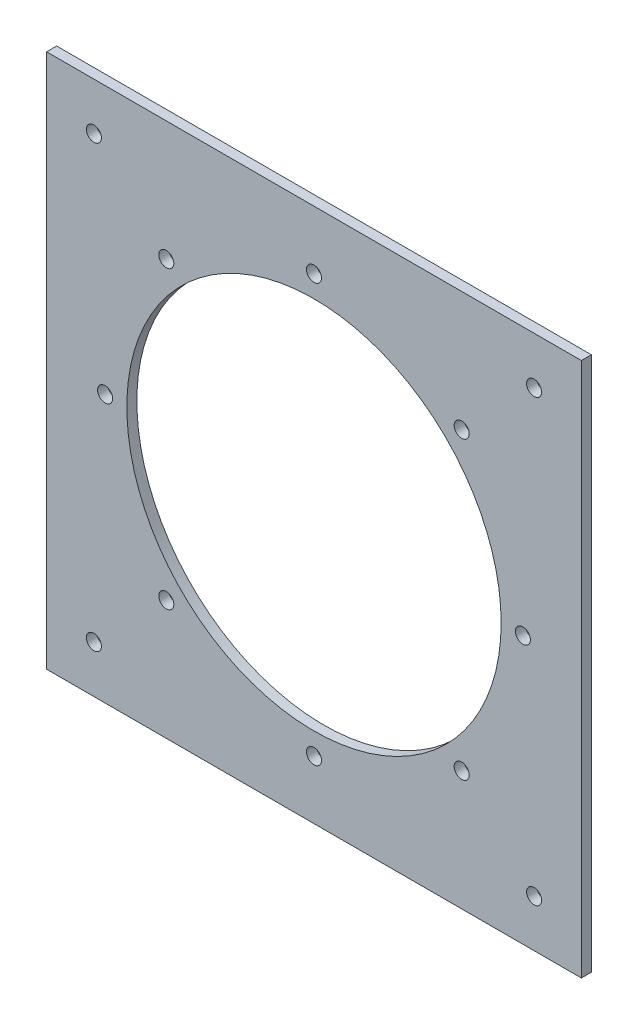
ISO-10303-21;
HEADER;
FILE_DESCRIPTION(('STEP AP214'),'2;1');
FILE_NAME('part.step','',(''),(''),'','','');
FILE_SCHEMA(('AUTOMOTIVE_DESIGN { 1 0 10303 214 1 1 1 1 }'));
ENDSEC;
DATA;
#1=APPLICATION_CONTEXT('core data for automotive mechanical design processes');
#2=APPLICATION_PROTOCOL_DEFINITION('international standard','automotive_design',2000,#1);
#3=PRODUCT_CONTEXT('',#1,'mechanical');
#4=PRODUCT('Part','Part','',(#3));
#5=PRODUCT_RELATED_PRODUCT_CATEGORY('part','',(#4));
#6=PRODUCT_DEFINITION_FORMATION('','',#4);
#7=PRODUCT_DEFINITION_CONTEXT('part definition',#1,'design');
#8=PRODUCT_DEFINITION('design','',#6,#7);
#9=PRODUCT_DEFINITION_SHAPE('','',#8);
#10=(LENGTH_UNIT() NAMED_UNIT(*) SI_UNIT(.MILLI.,.METRE.));
#11=(NAMED_UNIT(*) PLANE_ANGLE_UNIT() SI_UNIT($,.RADIAN.));
#12=(NAMED_UNIT(*) SI_UNIT($,.STERADIAN.) SOLID_ANGLE_UNIT());
#13=UNCERTAINTY_MEASURE_WITH_UNIT(LENGTH_MEASURE(1.E-05),#10,'distance_accuracy_value','');
#14=(GEOMETRIC_REPRESENTATION_CONTEXT(3) GLOBAL_UNCERTAINTY_ASSIGNED_CONTEXT((#13)) GLOBAL_UNIT_ASSIGNED_CONTEXT((#10,
#11,#12)) REPRESENTATION_CONTEXT('',''));
#15=CARTESIAN_POINT('',(0.,0.,0.));
#16=DIRECTION('',(0.,0.,1.));
#17=DIRECTION('',(1.,0.,0.));
#18=AXIS2_PLACEMENT_3D('',#15,#16,#17);
#19=CARTESIAN_POINT('',(0.,-80.,3.));
#20=DIRECTION('',(0.,-1.,0.));
#21=DIRECTION('',(0.,0.,-1.));
#22=AXIS2_PLACEMENT_3D('',#19,#20,#21);
#23=PLANE('',#22);
#24=DIRECTION('',(-1.,0.,0.));
#25=VECTOR('',#24,1.);
#26=CARTESIAN_POINT('',(0.,-80.,0.));
#27=LINE('',#26,#25);
#28=CARTESIAN_POINT('',(80.,-80.,0.));
#29=VERTEX_POINT('',#28);
#30=CARTESIAN_POINT('',(-80.,-80.,0.));
#31=VERTEX_POINT('',#30);
#32=EDGE_CURVE('E106',#29,#31,#27,.T.);
#33=ORIENTED_EDGE('',*,*,#32,.F.);
#34=DIRECTION('',(0.,0.,-1.));
#35=VECTOR('',#34,1.);
#36=CARTESIAN_POINT('',(80.,-80.,3.));
#37=LINE('',#36,#35);
#38=CARTESIAN_POINT('',(80.,-80.,3.));
#39=VERTEX_POINT('',#38);
#40=EDGE_CURVE('E11',#39,#29,#37,.T.);
#41=ORIENTED_EDGE('',*,*,#40,.F.);
#42=DIRECTION('',(-1.,0.,0.));
#43=VECTOR('',#42,1.);
#44=CARTESIAN_POINT('',(0.,-80.,3.));
#45=LINE('',#44,#43);
#46=CARTESIAN_POINT('',(-80.,-80.,3.));
#47=VERTEX_POINT('',#46);
#48=EDGE_CURVE('E90',#39,#47,#45,.T.);
#49=ORIENTED_EDGE('',*,*,#48,.T.);
#50=DIRECTION('',(0.,0.,-1.));
#51=VECTOR('',#50,1.);
#52=CARTESIAN_POINT('',(-80.,-80.,3.));
#53=LINE('',#52,#51);
#54=EDGE_CURVE('E52',#47,#31,#53,.T.);
#55=ORIENTED_EDGE('',*,*,#54,.T.);
#56=EDGE_LOOP('',(#33,#41,#49,#55));
#57=FACE_BOUND('',#56,.T.);
#58=ADVANCED_FACE('F35',(#57),#23,.T.);
#59=CARTESIAN_POINT('',(80.,0.,3.));
#60=DIRECTION('',(-1.,0.,0.));
#61=DIRECTION('',(0.,0.,1.));
#62=AXIS2_PLACEMENT_3D('',#59,#60,#61);
#63=PLANE('',#62);
#64=DIRECTION('',(0.,1.,0.));
#65=VECTOR('',#64,1.);
#66=CARTESIAN_POINT('',(80.,0.,0.));
#67=LINE('',#66,#65);
#68=CARTESIAN_POINT('',(80.,80.,0.));
#69=VERTEX_POINT('',#68);
#70=EDGE_CURVE('E95',#29,#69,#67,.T.);
#71=ORIENTED_EDGE('',*,*,#70,.T.);
#72=DIRECTION('',(0.,0.,-1.));
#73=VECTOR('',#72,1.);
#74=CARTESIAN_POINT('',(80.,80.,3.));
#75=LINE('',#74,#73);
#76=CARTESIAN_POINT('',(80.,80.,3.));
#77=VERTEX_POINT('',#76);
#78=EDGE_CURVE('E44',#77,#69,#75,.T.);
#79=ORIENTED_EDGE('',*,*,#78,.F.);
#80=DIRECTION('',(0.,1.,0.));
#81=VECTOR('',#80,1.);
#82=CARTESIAN_POINT('',(80.,0.,3.));
#83=LINE('',#82,#81);
#84=EDGE_CURVE('E86',#39,#77,#83,.T.);
#85=ORIENTED_EDGE('',*,*,#84,.F.);
#86=ORIENTED_EDGE('',*,*,#40,.T.);
#87=EDGE_LOOP('',(#71,#79,#85,#86));
#88=FACE_BOUND('',#87,.T.);
#89=ADVANCED_FACE('F93',(#88),#63,.F.);
#90=CARTESIAN_POINT('',(0.,80.,3.));
#91=DIRECTION('',(0.,-1.,0.));
#92=DIRECTION('',(0.,0.,-1.));
#93=AXIS2_PLACEMENT_3D('',#90,#91,#92);
#94=PLANE('',#93);
#95=DIRECTION('',(-1.,0.,0.));
#96=VECTOR('',#95,1.);
#97=CARTESIAN_POINT('',(0.,80.,0.));
#98=LINE('',#97,#96);
#99=CARTESIAN_POINT('',(-80.,80.,0.));
#100=VERTEX_POINT('',#99);
#101=EDGE_CURVE('E103',#69,#100,#98,.T.);
#102=ORIENTED_EDGE('',*,*,#101,.T.);
#103=DIRECTION('',(0.,0.,-1.));
#104=VECTOR('',#103,1.);
#105=CARTESIAN_POINT('',(-80.,80.,3.));
#106=LINE('',#105,#104);
#107=CARTESIAN_POINT('',(-80.,80.,3.));
#108=VERTEX_POINT('',#107);
#109=EDGE_CURVE('E66',#108,#100,#106,.T.);
#110=ORIENTED_EDGE('',*,*,#109,.F.);
#111=DIRECTION('',(-1.,0.,0.));
#112=VECTOR('',#111,1.);
#113=CARTESIAN_POINT('',(0.,80.,3.));
#114=LINE('',#113,#112);
#115=EDGE_CURVE('E78',#77,#108,#114,.T.);
#116=ORIENTED_EDGE('',*,*,#115,.F.);
#117=ORIENTED_EDGE('',*,*,#78,.T.);
#118=EDGE_LOOP('',(#102,#110,#116,#117));
#119=FACE_BOUND('',#118,.T.);
#120=ADVANCED_FACE('F80',(#119),#94,.F.);
#121=CARTESIAN_POINT('',(0.,0.,3.));
#122=DIRECTION('',(0.,0.,-1.));
#123=DIRECTION('',(-1.,0.,0.));
#124=AXIS2_PLACEMENT_3D('',#121,#122,#123);
#125=CYLINDRICAL_SURFACE('',#124,56.);
#126=CARTESIAN_POINT('',(0.,0.,3.));
#127=DIRECTION('',(0.,0.,1.));
#128=DIRECTION('',(1.,0.,0.));
#129=AXIS2_PLACEMENT_3D('',#126,#127,#128);
#130=CIRCLE('',#129,56.);
#131=CARTESIAN_POINT('',(56.,0.,3.));
#132=VERTEX_POINT('',#131);
#133=EDGE_CURVE('E102',#132,#132,#130,.T.);
#134=ORIENTED_EDGE('',*,*,#133,.T.);
#135=EDGE_LOOP('',(#134));
#136=FACE_BOUND('',#135,.T.);
#137=CARTESIAN_POINT('',(0.,0.,0.));
#138=DIRECTION('',(0.,0.,1.));
#139=DIRECTION('',(1.,0.,0.));
#140=AXIS2_PLACEMENT_3D('',#137,#138,#139);
#141=CIRCLE('',#140,56.);
#142=CARTESIAN_POINT('',(56.,0.,0.));
#143=VERTEX_POINT('',#142);
#144=EDGE_CURVE('E108',#143,#143,#141,.T.);
#145=ORIENTED_EDGE('',*,*,#144,.F.);
#146=EDGE_LOOP('',(#145));
#147=FACE_BOUND('',#146,.T.);
#148=ADVANCED_FACE('F37',(#136,#147),#125,.F.);
#149=CARTESIAN_POINT('',(-80.,0.,3.));
#150=DIRECTION('',(-1.,0.,0.));
#151=DIRECTION('',(0.,0.,1.));
#152=AXIS2_PLACEMENT_3D('',#149,#150,#151);
#153=PLANE('',#152);
#154=DIRECTION('',(0.,1.,0.));
#155=VECTOR('',#154,1.);
#156=CARTESIAN_POINT('',(-80.,0.,0.));
#157=LINE('',#156,#155);
#158=EDGE_CURVE('E99',#31,#100,#157,.T.);
#159=ORIENTED_EDGE('',*,*,#158,.F.);
#160=ORIENTED_EDGE('',*,*,#54,.F.);
#161=DIRECTION('',(0.,1.,0.));
#162=VECTOR('',#161,1.);
#163=CARTESIAN_POINT('',(-80.,0.,3.));
#164=LINE('',#163,#162);
#165=EDGE_CURVE('E85',#47,#108,#164,.T.);
#166=ORIENTED_EDGE('',*,*,#165,.T.);
#167=ORIENTED_EDGE('',*,*,#109,.T.);
#168=EDGE_LOOP('',(#159,#160,#166,#167));
#169=FACE_BOUND('',#168,.T.);
#170=ADVANCED_FACE('F219',(#169),#153,.T.);
#171=CARTESIAN_POINT('',(0.,0.,3.));
#172=DIRECTION('',(0.,0.,1.));
#173=DIRECTION('',(1.,0.,0.));
#174=AXIS2_PLACEMENT_3D('',#171,#172,#173);
#175=PLANE('',#174);
#176=CARTESIAN_POINT('',(0.,62.5,3.));
#177=DIRECTION('',(0.,0.,-1.));
#178=DIRECTION('',(-1.,0.,0.));
#179=AXIS2_PLACEMENT_3D('',#176,#177,#178);
#180=CIRCLE('',#179,2.25);
#181=CARTESIAN_POINT('',(-2.25,62.5,3.));
#182=VERTEX_POINT('',#181);
#183=EDGE_CURVE('E181',#182,#182,#180,.T.);
#184=ORIENTED_EDGE('',*,*,#183,.T.);
#185=EDGE_LOOP('',(#184));
#186=FACE_BOUND('',#185,.T.);
#187=CARTESIAN_POINT('',(-44.1941738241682,44.1941738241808,3.));
#188=DIRECTION('',(0.,0.,-1.));
#189=DIRECTION('',(-1.,0.,0.));
#190=AXIS2_PLACEMENT_3D('',#187,#188,#189);
#191=CIRCLE('',#190,2.25);
#192=CARTESIAN_POINT('',(-46.4441738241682,44.1941738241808,3.));
#193=VERTEX_POINT('',#192);
#194=EDGE_CURVE('E175',#193,#193,#191,.T.);
#195=ORIENTED_EDGE('',*,*,#194,.T.);
#196=EDGE_LOOP('',(#195));
#197=FACE_BOUND('',#196,.T.);
#198=CARTESIAN_POINT('',(-62.5000000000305,3.05196521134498E-11,3.));
#199=DIRECTION('',(0.,0.,-1.));
#200=DIRECTION('',(-1.,0.,0.));
#201=AXIS2_PLACEMENT_3D('',#198,#199,#200);
#202=CIRCLE('',#201,2.25);
#203=CARTESIAN_POINT('',(-64.7500000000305,3.05196521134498E-11,3.));
#204=VERTEX_POINT('',#203);
#205=EDGE_CURVE('E169',#204,#204,#202,.T.);
#206=ORIENTED_EDGE('',*,*,#205,.T.);
#207=EDGE_LOOP('',(#206));
#208=FACE_BOUND('',#207,.T.);
#209=CARTESIAN_POINT('',(-44.1941738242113,-44.1941738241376,3.));
#210=DIRECTION('',(0.,0.,-1.));
#211=DIRECTION('',(-1.,0.,0.));
#212=AXIS2_PLACEMENT_3D('',#209,#210,#211);
#213=CIRCLE('',#212,2.25);
#214=CARTESIAN_POINT('',(-46.4441738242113,-44.1941738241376,3.));
#215=VERTEX_POINT('',#214);
#216=EDGE_CURVE('E163',#215,#215,#213,.T.);
#217=ORIENTED_EDGE('',*,*,#216,.T.);
#218=EDGE_LOOP('',(#217));
#219=FACE_BOUND('',#218,.T.);
#220=CARTESIAN_POINT('',(-6.10393042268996E-11,-62.5,3.));
#221=DIRECTION('',(0.,0.,-1.));
#222=DIRECTION('',(-1.,0.,0.));
#223=AXIS2_PLACEMENT_3D('',#220,#221,#222);
#224=CIRCLE('',#223,2.25);
#225=CARTESIAN_POINT('',(-2.25000000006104,-62.5,3.));
#226=VERTEX_POINT('',#225);
#227=EDGE_CURVE('E157',#226,#226,#224,.T.);
#228=ORIENTED_EDGE('',*,*,#227,.T.);
#229=EDGE_LOOP('',(#228));
#230=FACE_BOUND('',#229,.T.);
#231=CARTESIAN_POINT('',(44.1941738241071,-44.1941738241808,3.));
#232=DIRECTION('',(0.,0.,-1.));
#233=DIRECTION('',(-1.,0.,0.));
#234=AXIS2_PLACEMENT_3D('',#231,#232,#233);
#235=CIRCLE('',#234,2.25);
#236=CARTESIAN_POINT('',(41.9441738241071,-44.1941738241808,3.));
#237=VERTEX_POINT('',#236);
#238=EDGE_CURVE('E151',#237,#237,#235,.T.);
#239=ORIENTED_EDGE('',*,*,#238,.T.);
#240=EDGE_LOOP('',(#239));
#241=FACE_BOUND('',#240,.T.);
#242=CARTESIAN_POINT('',(62.4999999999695,-3.05273061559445E-11,3.));
#243=DIRECTION('',(0.,0.,-1.));
#244=DIRECTION('',(-1.,0.,0.));
#245=AXIS2_PLACEMENT_3D('',#242,#243,#244);
#246=CIRCLE('',#245,2.25);
#247=CARTESIAN_POINT('',(60.2499999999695,-3.05273061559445E-11,3.));
#248=VERTEX_POINT('',#247);
#249=EDGE_CURVE('E145',#248,#248,#246,.T.);
#250=ORIENTED_EDGE('',*,*,#249,.T.);
#251=EDGE_LOOP('',(#250));
#252=FACE_BOUND('',#251,.T.);
#253=CARTESIAN_POINT('',(44.1941738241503,44.1941738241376,3.));
#254=DIRECTION('',(0.,0.,-1.));
#255=DIRECTION('',(-1.,0.,0.));
#256=AXIS2_PLACEMENT_3D('',#253,#254,#255);
#257=CIRCLE('',#256,2.25);
#258=CARTESIAN_POINT('',(41.9441738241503,44.1941738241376,3.));
#259=VERTEX_POINT('',#258);
#260=EDGE_CURVE('E139',#259,#259,#257,.T.);
#261=ORIENTED_EDGE('',*,*,#260,.T.);
#262=EDGE_LOOP('',(#261));
#263=FACE_BOUND('',#262,.T.);
#264=CARTESIAN_POINT('',(65.857864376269,65.8578643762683,3.));
#265=DIRECTION('',(0.,0.,-1.));
#266=DIRECTION('',(-1.,0.,0.));
#267=AXIS2_PLACEMENT_3D('',#264,#265,#266);
#268=CIRCLE('',#267,2.25);
#269=CARTESIAN_POINT('',(63.607864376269,65.8578643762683,3.));
#270=VERTEX_POINT('',#269);
#271=EDGE_CURVE('E133',#270,#270,#268,.T.);
#272=ORIENTED_EDGE('',*,*,#271,.T.);
#273=EDGE_LOOP('',(#272));
#274=FACE_BOUND('',#273,.T.);
#275=CARTESIAN_POINT('',(-65.8578643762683,65.8578643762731,3.));
#276=DIRECTION('',(0.,0.,-1.));
#277=DIRECTION('',(-1.,0.,0.));
#278=AXIS2_PLACEMENT_3D('',#275,#276,#277);
#279=CIRCLE('',#278,2.25);
#280=CARTESIAN_POINT('',(-68.1078643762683,65.8578643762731,3.));
#281=VERTEX_POINT('',#280);
#282=EDGE_CURVE('E127',#281,#281,#279,.T.);
#283=ORIENTED_EDGE('',*,*,#282,.T.);
#284=EDGE_LOOP('',(#283));
#285=FACE_BOUND('',#284,.T.);
#286=CARTESIAN_POINT('',(-65.8578643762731,-65.8578643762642,3.));
#287=DIRECTION('',(0.,0.,-1.));
#288=DIRECTION('',(-1.,0.,0.));
#289=AXIS2_PLACEMENT_3D('',#286,#287,#288);
#290=CIRCLE('',#289,2.25);
#291=CARTESIAN_POINT('',(-68.1078643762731,-65.8578643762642,3.));
#292=VERTEX_POINT('',#291);
#293=EDGE_CURVE('E121',#292,#292,#290,.T.);
#294=ORIENTED_EDGE('',*,*,#293,.T.);
#295=EDGE_LOOP('',(#294));
#296=FACE_BOUND('',#295,.T.);
#297=CARTESIAN_POINT('',(65.8578643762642,-65.857864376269,3.));
#298=DIRECTION('',(0.,0.,-1.));
#299=DIRECTION('',(-1.,0.,0.));
#300=AXIS2_PLACEMENT_3D('',#297,#298,#299);
#301=CIRCLE('',#300,2.25);
#302=CARTESIAN_POINT('',(63.6078643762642,-65.857864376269,3.));
#303=VERTEX_POINT('',#302);
#304=EDGE_CURVE('E111',#303,#303,#301,.T.);
#305=ORIENTED_EDGE('',*,*,#304,.T.);
#306=EDGE_LOOP('',(#305));
#307=FACE_BOUND('',#306,.T.);
#308=ORIENTED_EDGE('',*,*,#133,.F.);
#309=EDGE_LOOP('',(#308));
#310=FACE_BOUND('',#309,.T.);
#311=ORIENTED_EDGE('',*,*,#48,.F.);
#312=ORIENTED_EDGE('',*,*,#84,.T.);
#313=ORIENTED_EDGE('',*,*,#115,.T.);
#314=ORIENTED_EDGE('',*,*,#165,.F.);
#315=EDGE_LOOP('',(#311,#312,#313,#314));
#316=FACE_BOUND('',#315,.T.);
#317=ADVANCED_FACE('F89',(#186,#197,#208,#219,#230,#241,#252,#263,#274,#285,#296,#307,#310,
#316),#175,.T.);
#318=CARTESIAN_POINT('',(0.,0.,0.));
#319=DIRECTION('',(0.,0.,1.));
#320=DIRECTION('',(1.,0.,0.));
#321=AXIS2_PLACEMENT_3D('',#318,#319,#320);
#322=PLANE('',#321);
#323=CARTESIAN_POINT('',(0.,62.5,0.));
#324=DIRECTION('',(0.,0.,-1.));
#325=DIRECTION('',(-1.,0.,0.));
#326=AXIS2_PLACEMENT_3D('',#323,#324,#325);
#327=CIRCLE('',#326,2.25);
#328=CARTESIAN_POINT('',(-2.25,62.5,0.));
#329=VERTEX_POINT('',#328);
#330=EDGE_CURVE('E184',#329,#329,#327,.T.);
#331=ORIENTED_EDGE('',*,*,#330,.F.);
#332=EDGE_LOOP('',(#331));
#333=FACE_BOUND('',#332,.T.);
#334=CARTESIAN_POINT('',(-44.1941738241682,44.1941738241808,0.));
#335=DIRECTION('',(0.,0.,-1.));
#336=DIRECTION('',(-1.,0.,0.));
#337=AXIS2_PLACEMENT_3D('',#334,#335,#336);
#338=CIRCLE('',#337,2.25);
#339=CARTESIAN_POINT('',(-46.4441738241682,44.1941738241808,0.));
#340=VERTEX_POINT('',#339);
#341=EDGE_CURVE('E178',#340,#340,#338,.T.);
#342=ORIENTED_EDGE('',*,*,#341,.F.);
#343=EDGE_LOOP('',(#342));
#344=FACE_BOUND('',#343,.T.);
#345=CARTESIAN_POINT('',(-62.5000000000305,3.05196521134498E-11,0.));
#346=DIRECTION('',(0.,0.,-1.));
#347=DIRECTION('',(-1.,0.,0.));
#348=AXIS2_PLACEMENT_3D('',#345,#346,#347);
#349=CIRCLE('',#348,2.25);
#350=CARTESIAN_POINT('',(-64.7500000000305,3.05196521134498E-11,0.));
#351=VERTEX_POINT('',#350);
#352=EDGE_CURVE('E172',#351,#351,#349,.T.);
#353=ORIENTED_EDGE('',*,*,#352,.F.);
#354=EDGE_LOOP('',(#353));
#355=FACE_BOUND('',#354,.T.);
#356=CARTESIAN_POINT('',(-44.1941738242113,-44.1941738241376,0.));
#357=DIRECTION('',(0.,0.,-1.));
#358=DIRECTION('',(-1.,0.,0.));
#359=AXIS2_PLACEMENT_3D('',#356,#357,#358);
#360=CIRCLE('',#359,2.25);
#361=CARTESIAN_POINT('',(-46.4441738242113,-44.1941738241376,0.));
#362=VERTEX_POINT('',#361);
#363=EDGE_CURVE('E166',#362,#362,#360,.T.);
#364=ORIENTED_EDGE('',*,*,#363,.F.);
#365=EDGE_LOOP('',(#364));
#366=FACE_BOUND('',#365,.T.);
#367=CARTESIAN_POINT('',(-6.10393042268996E-11,-62.5,0.));
#368=DIRECTION('',(0.,0.,-1.));
#369=DIRECTION('',(-1.,0.,0.));
#370=AXIS2_PLACEMENT_3D('',#367,#368,#369);
#371=CIRCLE('',#370,2.25);
#372=CARTESIAN_POINT('',(-2.25000000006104,-62.5,0.));
#373=VERTEX_POINT('',#372);
#374=EDGE_CURVE('E160',#373,#373,#371,.T.);
#375=ORIENTED_EDGE('',*,*,#374,.F.);
#376=EDGE_LOOP('',(#375));
#377=FACE_BOUND('',#376,.T.);
#378=CARTESIAN_POINT('',(44.1941738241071,-44.1941738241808,0.));
#379=DIRECTION('',(0.,0.,-1.));
#380=DIRECTION('',(-1.,0.,0.));
#381=AXIS2_PLACEMENT_3D('',#378,#379,#380);
#382=CIRCLE('',#381,2.25);
#383=CARTESIAN_POINT('',(41.9441738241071,-44.1941738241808,0.));
#384=VERTEX_POINT('',#383);
#385=EDGE_CURVE('E154',#384,#384,#382,.T.);
#386=ORIENTED_EDGE('',*,*,#385,.F.);
#387=EDGE_LOOP('',(#386));
#388=FACE_BOUND('',#387,.T.);
#389=CARTESIAN_POINT('',(62.4999999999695,-3.05273061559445E-11,0.));
#390=DIRECTION('',(0.,0.,-1.));
#391=DIRECTION('',(-1.,0.,0.));
#392=AXIS2_PLACEMENT_3D('',#389,#390,#391);
#393=CIRCLE('',#392,2.25);
#394=CARTESIAN_POINT('',(60.2499999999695,-3.05273061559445E-11,0.));
#395=VERTEX_POINT('',#394);
#396=EDGE_CURVE('E148',#395,#395,#393,.T.);
#397=ORIENTED_EDGE('',*,*,#396,.F.);
#398=EDGE_LOOP('',(#397));
#399=FACE_BOUND('',#398,.T.);
#400=CARTESIAN_POINT('',(44.1941738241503,44.1941738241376,0.));
#401=DIRECTION('',(0.,0.,-1.));
#402=DIRECTION('',(-1.,0.,0.));
#403=AXIS2_PLACEMENT_3D('',#400,#401,#402);
#404=CIRCLE('',#403,2.25);
#405=CARTESIAN_POINT('',(41.9441738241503,44.1941738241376,0.));
#406=VERTEX_POINT('',#405);
#407=EDGE_CURVE('E142',#406,#406,#404,.T.);
#408=ORIENTED_EDGE('',*,*,#407,.F.);
#409=EDGE_LOOP('',(#408));
#410=FACE_BOUND('',#409,.T.);
#411=CARTESIAN_POINT('',(65.857864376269,65.8578643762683,0.));
#412=DIRECTION('',(0.,0.,-1.));
#413=DIRECTION('',(-1.,0.,0.));
#414=AXIS2_PLACEMENT_3D('',#411,#412,#413);
#415=CIRCLE('',#414,2.25);
#416=CARTESIAN_POINT('',(63.607864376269,65.8578643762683,0.));
#417=VERTEX_POINT('',#416);
#418=EDGE_CURVE('E136',#417,#417,#415,.T.);
#419=ORIENTED_EDGE('',*,*,#418,.F.);
#420=EDGE_LOOP('',(#419));
#421=FACE_BOUND('',#420,.T.);
#422=CARTESIAN_POINT('',(-65.8578643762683,65.8578643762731,0.));
#423=DIRECTION('',(0.,0.,-1.));
#424=DIRECTION('',(-1.,0.,0.));
#425=AXIS2_PLACEMENT_3D('',#422,#423,#424);
#426=CIRCLE('',#425,2.25);
#427=CARTESIAN_POINT('',(-68.1078643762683,65.8578643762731,0.));
#428=VERTEX_POINT('',#427);
#429=EDGE_CURVE('E130',#428,#428,#426,.T.);
#430=ORIENTED_EDGE('',*,*,#429,.F.);
#431=EDGE_LOOP('',(#430));
#432=FACE_BOUND('',#431,.T.);
#433=CARTESIAN_POINT('',(-65.8578643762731,-65.8578643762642,0.));
#434=DIRECTION('',(0.,0.,-1.));
#435=DIRECTION('',(-1.,0.,0.));
#436=AXIS2_PLACEMENT_3D('',#433,#434,#435);
#437=CIRCLE('',#436,2.25);
#438=CARTESIAN_POINT('',(-68.1078643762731,-65.8578643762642,0.));
#439=VERTEX_POINT('',#438);
#440=EDGE_CURVE('E124',#439,#439,#437,.T.);
#441=ORIENTED_EDGE('',*,*,#440,.F.);
#442=EDGE_LOOP('',(#441));
#443=FACE_BOUND('',#442,.T.);
#444=CARTESIAN_POINT('',(65.8578643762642,-65.857864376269,0.));
#445=DIRECTION('',(0.,0.,-1.));
#446=DIRECTION('',(-1.,0.,0.));
#447=AXIS2_PLACEMENT_3D('',#444,#445,#446);
#448=CIRCLE('',#447,2.25);
#449=CARTESIAN_POINT('',(63.6078643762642,-65.857864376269,0.));
#450=VERTEX_POINT('',#449);
#451=EDGE_CURVE('E118',#450,#450,#448,.T.);
#452=ORIENTED_EDGE('',*,*,#451,.F.);
#453=EDGE_LOOP('',(#452));
#454=FACE_BOUND('',#453,.T.);
#455=ORIENTED_EDGE('',*,*,#144,.T.);
#456=EDGE_LOOP('',(#455));
#457=FACE_BOUND('',#456,.T.);
#458=ORIENTED_EDGE('',*,*,#32,.T.);
#459=ORIENTED_EDGE('',*,*,#158,.T.);
#460=ORIENTED_EDGE('',*,*,#101,.F.);
#461=ORIENTED_EDGE('',*,*,#70,.F.);
#462=EDGE_LOOP('',(#458,#459,#460,#461));
#463=FACE_BOUND('',#462,.T.);
#464=ADVANCED_FACE('F190',(#333,#344,#355,#366,#377,#388,#399,#410,#421,#432,#443,#454,#457,
#463),#322,.F.);
#465=CARTESIAN_POINT('',(65.8578643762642,-65.857864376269,0.));
#466=DIRECTION('',(0.,0.,-1.));
#467=DIRECTION('',(-1.,0.,0.));
#468=AXIS2_PLACEMENT_3D('',#465,#466,#467);
#469=CYLINDRICAL_SURFACE('',#468,2.25);
#470=ORIENTED_EDGE('',*,*,#304,.F.);
#471=EDGE_LOOP('',(#470));
#472=FACE_BOUND('',#471,.T.);
#473=ORIENTED_EDGE('',*,*,#451,.T.);
#474=EDGE_LOOP('',(#473));
#475=FACE_BOUND('',#474,.T.);
#476=ADVANCED_FACE('F193',(#472,#475),#469,.F.);
#477=CARTESIAN_POINT('',(-65.8578643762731,-65.8578643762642,0.));
#478=DIRECTION('',(0.,0.,-1.));
#479=DIRECTION('',(-1.,0.,0.));
#480=AXIS2_PLACEMENT_3D('',#477,#478,#479);
#481=CYLINDRICAL_SURFACE('',#480,2.25);
#482=ORIENTED_EDGE('',*,*,#293,.F.);
#483=EDGE_LOOP('',(#482));
#484=FACE_BOUND('',#483,.T.);
#485=ORIENTED_EDGE('',*,*,#440,.T.);
#486=EDGE_LOOP('',(#485));
#487=FACE_BOUND('',#486,.T.);
#488=ADVANCED_FACE('F273',(#484,#487),#481,.F.);
#489=CARTESIAN_POINT('',(-65.8578643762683,65.8578643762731,0.));
#490=DIRECTION('',(0.,0.,-1.));
#491=DIRECTION('',(-1.,0.,0.));
#492=AXIS2_PLACEMENT_3D('',#489,#490,#491);
#493=CYLINDRICAL_SURFACE('',#492,2.25);
#494=ORIENTED_EDGE('',*,*,#282,.F.);
#495=EDGE_LOOP('',(#494));
#496=FACE_BOUND('',#495,.T.);
#497=ORIENTED_EDGE('',*,*,#429,.T.);
#498=EDGE_LOOP('',(#497));
#499=FACE_BOUND('',#498,.T.);
#500=ADVANCED_FACE('F283',(#496,#499),#493,.F.);
#501=CARTESIAN_POINT('',(65.857864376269,65.8578643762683,0.));
#502=DIRECTION('',(0.,0.,-1.));
#503=DIRECTION('',(-1.,0.,0.));
#504=AXIS2_PLACEMENT_3D('',#501,#502,#503);
#505=CYLINDRICAL_SURFACE('',#504,2.25);
#506=ORIENTED_EDGE('',*,*,#271,.F.);
#507=EDGE_LOOP('',(#506));
#508=FACE_BOUND('',#507,.T.);
#509=ORIENTED_EDGE('',*,*,#418,.T.);
#510=EDGE_LOOP('',(#509));
#511=FACE_BOUND('',#510,.T.);
#512=ADVANCED_FACE('F293',(#508,#511),#505,.F.);
#513=CARTESIAN_POINT('',(44.1941738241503,44.1941738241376,0.));
#514=DIRECTION('',(0.,0.,-1.));
#515=DIRECTION('',(-1.,0.,0.));
#516=AXIS2_PLACEMENT_3D('',#513,#514,#515);
#517=CYLINDRICAL_SURFACE('',#516,2.25);
#518=ORIENTED_EDGE('',*,*,#260,.F.);
#519=EDGE_LOOP('',(#518));
#520=FACE_BOUND('',#519,.T.);
#521=ORIENTED_EDGE('',*,*,#407,.T.);
#522=EDGE_LOOP('',(#521));
#523=FACE_BOUND('',#522,.T.);
#524=ADVANCED_FACE('F303',(#520,#523),#517,.F.);
#525=CARTESIAN_POINT('',(62.4999999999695,-3.05273061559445E-11,0.));
#526=DIRECTION('',(0.,0.,-1.));
#527=DIRECTION('',(-1.,0.,0.));
#528=AXIS2_PLACEMENT_3D('',#525,#526,#527);
#529=CYLINDRICAL_SURFACE('',#528,2.25);
#530=ORIENTED_EDGE('',*,*,#249,.F.);
#531=EDGE_LOOP('',(#530));
#532=FACE_BOUND('',#531,.T.);
#533=ORIENTED_EDGE('',*,*,#396,.T.);
#534=EDGE_LOOP('',(#533));
#535=FACE_BOUND('',#534,.T.);
#536=ADVANCED_FACE('F313',(#532,#535),#529,.F.);
#537=CARTESIAN_POINT('',(44.1941738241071,-44.1941738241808,0.));
#538=DIRECTION('',(0.,0.,-1.));
#539=DIRECTION('',(-1.,0.,0.));
#540=AXIS2_PLACEMENT_3D('',#537,#538,#539);
#541=CYLINDRICAL_SURFACE('',#540,2.25);
#542=ORIENTED_EDGE('',*,*,#238,.F.);
#543=EDGE_LOOP('',(#542));
#544=FACE_BOUND('',#543,.T.);
#545=ORIENTED_EDGE('',*,*,#385,.T.);
#546=EDGE_LOOP('',(#545));
#547=FACE_BOUND('',#546,.T.);
#548=ADVANCED_FACE('F323',(#544,#547),#541,.F.);
#549=CARTESIAN_POINT('',(-6.10393042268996E-11,-62.5,0.));
#550=DIRECTION('',(0.,0.,-1.));
#551=DIRECTION('',(-1.,0.,0.));
#552=AXIS2_PLACEMENT_3D('',#549,#550,#551);
#553=CYLINDRICAL_SURFACE('',#552,2.25);
#554=ORIENTED_EDGE('',*,*,#227,.F.);
#555=EDGE_LOOP('',(#554));
#556=FACE_BOUND('',#555,.T.);
#557=ORIENTED_EDGE('',*,*,#374,.T.);
#558=EDGE_LOOP('',(#557));
#559=FACE_BOUND('',#558,.T.);
#560=ADVANCED_FACE('F333',(#556,#559),#553,.F.);
#561=CARTESIAN_POINT('',(-44.1941738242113,-44.1941738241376,0.));
#562=DIRECTION('',(0.,0.,-1.));
#563=DIRECTION('',(-1.,0.,0.));
#564=AXIS2_PLACEMENT_3D('',#561,#562,#563);
#565=CYLINDRICAL_SURFACE('',#564,2.25);
#566=ORIENTED_EDGE('',*,*,#216,.F.);
#567=EDGE_LOOP('',(#566));
#568=FACE_BOUND('',#567,.T.);
#569=ORIENTED_EDGE('',*,*,#363,.T.);
#570=EDGE_LOOP('',(#569));
#571=FACE_BOUND('',#570,.T.);
#572=ADVANCED_FACE('F343',(#568,#571),#565,.F.);
#573=CARTESIAN_POINT('',(-62.5000000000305,3.05196521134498E-11,0.));
#574=DIRECTION('',(0.,0.,-1.));
#575=DIRECTION('',(-1.,0.,0.));
#576=AXIS2_PLACEMENT_3D('',#573,#574,#575);
#577=CYLINDRICAL_SURFACE('',#576,2.25);
#578=ORIENTED_EDGE('',*,*,#205,.F.);
#579=EDGE_LOOP('',(#578));
#580=FACE_BOUND('',#579,.T.);
#581=ORIENTED_EDGE('',*,*,#352,.T.);
#582=EDGE_LOOP('',(#581));
#583=FACE_BOUND('',#582,.T.);
#584=ADVANCED_FACE('F353',(#580,#583),#577,.F.);
#585=CARTESIAN_POINT('',(-44.1941738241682,44.1941738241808,0.));
#586=DIRECTION('',(0.,0.,-1.));
#587=DIRECTION('',(-1.,0.,0.));
#588=AXIS2_PLACEMENT_3D('',#585,#586,#587);
#589=CYLINDRICAL_SURFACE('',#588,2.25);
#590=ORIENTED_EDGE('',*,*,#194,.F.);
#591=EDGE_LOOP('',(#590));
#592=FACE_BOUND('',#591,.T.);
#593=ORIENTED_EDGE('',*,*,#341,.T.);
#594=EDGE_LOOP('',(#593));
#595=FACE_BOUND('',#594,.T.);
#596=ADVANCED_FACE('F363',(#592,#595),#589,.F.);
#597=CARTESIAN_POINT('',(0.,62.5,0.));
#598=DIRECTION('',(0.,0.,-1.));
#599=DIRECTION('',(-1.,0.,0.));
#600=AXIS2_PLACEMENT_3D('',#597,#598,#599);
#601=CYLINDRICAL_SURFACE('',#600,2.25);
#602=ORIENTED_EDGE('',*,*,#183,.F.);
#603=EDGE_LOOP('',(#602));
#604=FACE_BOUND('',#603,.T.);
#605=ORIENTED_EDGE('',*,*,#330,.T.);
#606=EDGE_LOOP('',(#605));
#607=FACE_BOUND('',#606,.T.);
#608=ADVANCED_FACE('F188',(#604,#607),#601,.F.);
#609=CLOSED_SHELL('',(#58,#89,#120,#148,#170,#317,#464,#476,#488,#500,#512,#524,#536,#548,#560,
#572,#584,#596,#608));
#610=MANIFOLD_SOLID_BREP('B2',#609);
#611=ADVANCED_BREP_SHAPE_REPRESENTATION('',(#18,#610),#14);
#612=SHAPE_DEFINITION_REPRESENTATION(#9,#611);
ENDSEC;
END-ISO-10303-21;
